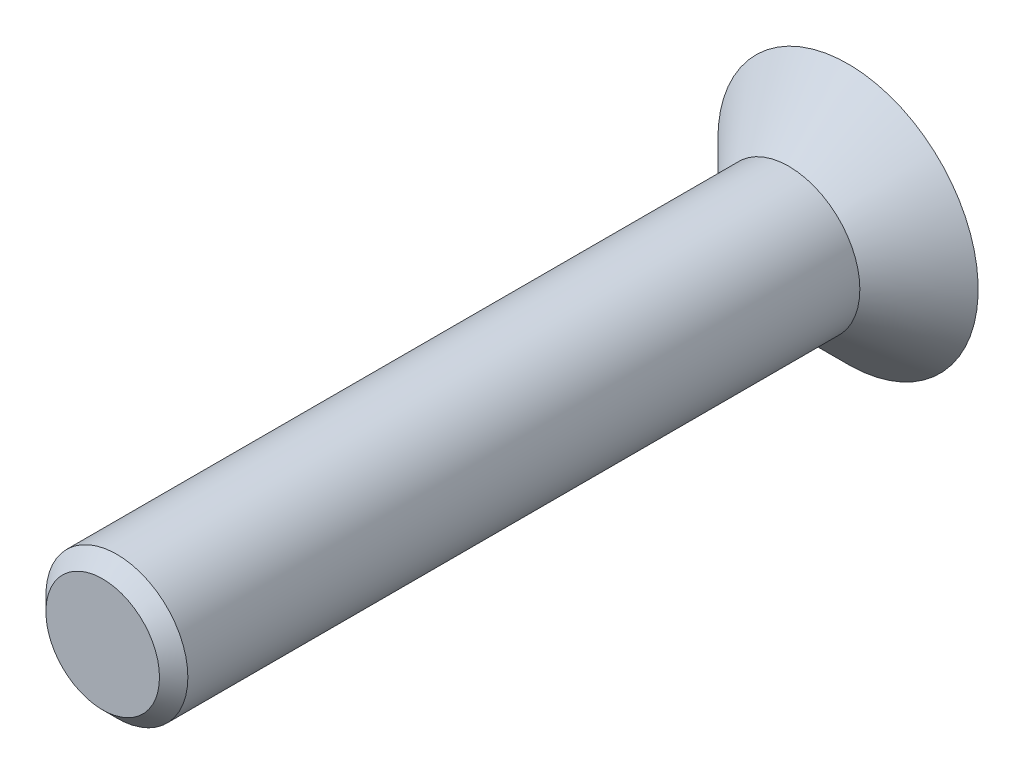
from build123d import *

# Parameters (mm, degrees)
FENTE1_DEPTH    = 4.8
ESQUISSE3_W     = 1.5
ESQUISSE3_H     = 14.5
CHANFREIN1_SIZE = 0.3


with BuildPart() as part:
    # Esquisse1 → Base-R_volution (revolve)
    with BuildSketch(Plane(origin=(0, 0, 0), x_dir=(1, 0, 0), z_dir=(0, 1, 0))):
        Polygon((1.5, 0), (2.75, 1.25), (0, 1.25), (0, 0), align=None)
    revolve(axis=Axis((0, 0, 0), (0, 0, -1)))

    # Esquisse2 → fente1 (cut)
    with BuildSketch(Plane.XY.offset(-1.25)):
        Polygon((1, -0.577350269), (1, 0.577350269), (0, 1.154700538), (-1, 0.577350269), (-1, -0.577350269), (0, -1.154700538), align=None)
    extrude(amount=FENTE1_DEPTH, mode=Mode.SUBTRACT)

    # Esquisse3 → Boss.-R_vol.1 (revolve)
    with BuildSketch(Plane(origin=(0, 0, 0), x_dir=(1, 0, 0), z_dir=(0, 1, 0))):
        with Locations((0.75, -7.25)):
            Rectangle(ESQUISSE3_W, ESQUISSE3_H)
    revolve(axis=Axis((0, 0, 0), (0, 0, 1)))

    # Chanfrein1
    chanfrein1_edges = [part.edges().sort_by_distance(p)[0] for p in [
        (-1.5, 0, 14.5),
    ]]
    chamfer(chanfrein1_edges, length=CHANFREIN1_SIZE)


solid = part.part
